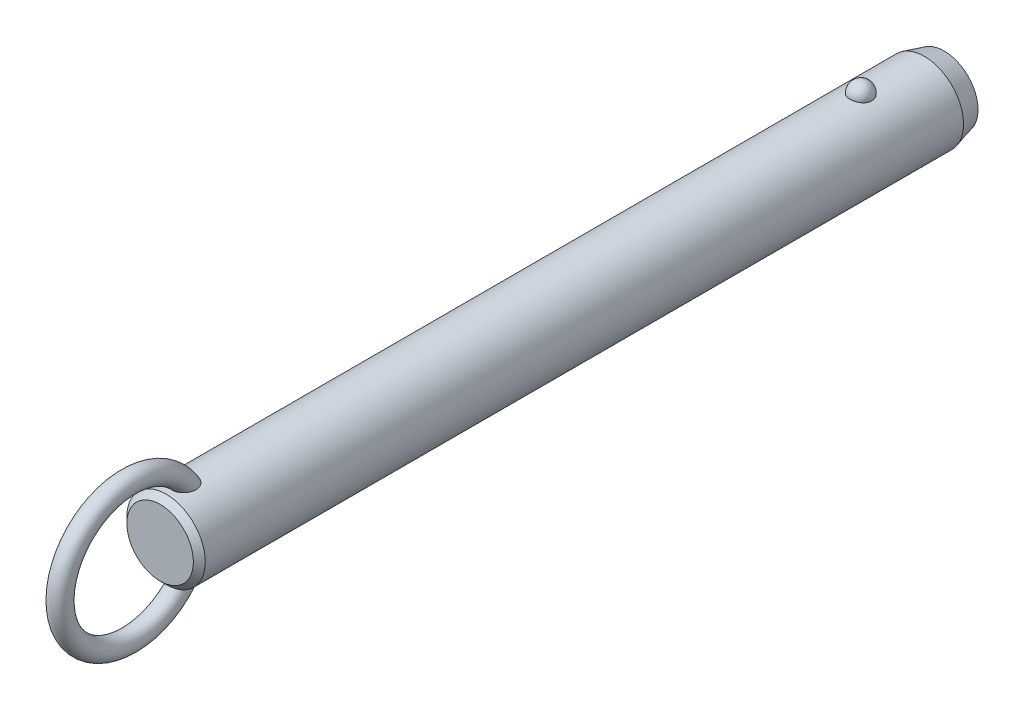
ISO-10303-21;
HEADER;
FILE_DESCRIPTION(('STEP AP214'),'2;1');
FILE_NAME('part.step','',(''),(''),'','','');
FILE_SCHEMA(('AUTOMOTIVE_DESIGN { 1 0 10303 214 1 1 1 1 }'));
ENDSEC;
DATA;
#1=APPLICATION_CONTEXT('core data for automotive mechanical design processes');
#2=APPLICATION_PROTOCOL_DEFINITION('international standard','automotive_design',2000,#1);
#3=PRODUCT_CONTEXT('',#1,'mechanical');
#4=PRODUCT('Part','Part','',(#3));
#5=PRODUCT_RELATED_PRODUCT_CATEGORY('part','',(#4));
#6=PRODUCT_DEFINITION_FORMATION('','',#4);
#7=PRODUCT_DEFINITION_CONTEXT('part definition',#1,'design');
#8=PRODUCT_DEFINITION('design','',#6,#7);
#9=PRODUCT_DEFINITION_SHAPE('','',#8);
#10=(LENGTH_UNIT() NAMED_UNIT(*) SI_UNIT(.MILLI.,.METRE.));
#11=(NAMED_UNIT(*) PLANE_ANGLE_UNIT() SI_UNIT($,.RADIAN.));
#12=(NAMED_UNIT(*) SI_UNIT($,.STERADIAN.) SOLID_ANGLE_UNIT());
#13=UNCERTAINTY_MEASURE_WITH_UNIT(LENGTH_MEASURE(1.E-05),#10,'distance_accuracy_value','');
#14=(GEOMETRIC_REPRESENTATION_CONTEXT(3) GLOBAL_UNCERTAINTY_ASSIGNED_CONTEXT((#13)) GLOBAL_UNIT_ASSIGNED_CONTEXT((#10,
#11,#12)) REPRESENTATION_CONTEXT('',''));
#15=CARTESIAN_POINT('',(0.,0.,0.));
#16=DIRECTION('',(0.,0.,1.));
#17=DIRECTION('',(1.,0.,0.));
#18=AXIS2_PLACEMENT_3D('',#15,#16,#17);
#19=CARTESIAN_POINT('',(0.,0.,129.5));
#20=DIRECTION('',(0.,0.,-1.));
#21=DIRECTION('',(-1.,0.,0.));
#22=AXIS2_PLACEMENT_3D('',#19,#20,#21);
#23=CYLINDRICAL_SURFACE('',#22,7.9);
#24=CARTESIAN_POINT('',(2.1785689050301,7.59367088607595,-2.19999999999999));
#25=CARTESIAN_POINT('',(2.17856679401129,7.59367269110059,-2.07701843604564));
#26=CARTESIAN_POINT('',(2.16853481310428,7.59657145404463,-1.95401006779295));
#27=CARTESIAN_POINT('',(2.12864689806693,7.607843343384,-1.71147811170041));
#28=CARTESIAN_POINT('',(2.09878338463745,7.61621856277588,-1.59195587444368));
#29=CARTESIAN_POINT('',(2.0199931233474,7.63749180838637,-1.3598563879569));
#30=CARTESIAN_POINT('',(1.97107475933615,7.6503878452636,-1.24727610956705));
#31=CARTESIAN_POINT('',(1.85539377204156,7.67926115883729,-1.03213234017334));
#32=CARTESIAN_POINT('',(1.78863158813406,7.69523835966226,-0.929568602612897));
#33=CARTESIAN_POINT('',(1.63856494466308,7.7285848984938,-0.736786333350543));
#34=CARTESIAN_POINT('',(1.55518140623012,7.7459606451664,-0.646630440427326));
#35=CARTESIAN_POINT('',(1.37422937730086,7.78009978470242,-0.481747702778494));
#36=CARTESIAN_POINT('',(1.27666086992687,7.79686317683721,-0.407020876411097));
#37=CARTESIAN_POINT('',(1.07024728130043,7.82786153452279,-0.275278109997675));
#38=CARTESIAN_POINT('',(0.961434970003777,7.84210353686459,-0.218212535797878));
#39=CARTESIAN_POINT('',(0.735351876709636,7.86652194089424,-0.123146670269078));
#40=CARTESIAN_POINT('',(0.618082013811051,7.87669878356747,-0.085144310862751));
#41=CARTESIAN_POINT('',(0.380637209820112,7.89170521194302,-0.0298158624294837));
#42=CARTESIAN_POINT('',(0.260550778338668,7.89662650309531,-0.0121347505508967));
#43=CARTESIAN_POINT('',(0.0190117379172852,7.90090003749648,0.00324379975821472));
#44=CARTESIAN_POINT('',(-0.102440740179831,7.90025280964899,0.00094313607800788));
#45=CARTESIAN_POINT('',(-0.341452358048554,7.89351056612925,-0.0233955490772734));
#46=CARTESIAN_POINT('',(-0.459042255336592,7.88749257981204,-0.0451545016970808));
#47=CARTESIAN_POINT('',(-0.688796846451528,7.87075812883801,-0.107408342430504));
#48=CARTESIAN_POINT('',(-0.800961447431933,7.86004158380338,-0.147903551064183));
#49=CARTESIAN_POINT('',(-1.01743634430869,7.83497131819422,-0.246799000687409));
#50=CARTESIAN_POINT('',(-1.12169791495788,7.82059709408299,-0.305300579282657));
#51=CARTESIAN_POINT('',(-1.31891765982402,7.78976470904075,-0.438549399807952));
#52=CARTESIAN_POINT('',(-1.41187469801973,7.77330633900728,-0.513298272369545));
#53=CARTESIAN_POINT('',(-1.58577142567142,7.73972434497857,-0.678622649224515));
#54=CARTESIAN_POINT('',(-1.66645140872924,7.72259402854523,-0.769470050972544));
#55=CARTESIAN_POINT('',(-1.81161503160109,7.68983776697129,-0.963538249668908));
#56=CARTESIAN_POINT('',(-1.87609753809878,7.6742119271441,-1.06675991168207));
#57=CARTESIAN_POINT('',(-1.98790138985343,7.6460202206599,-1.28401170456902));
#58=CARTESIAN_POINT('',(-2.03501994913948,7.63349104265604,-1.39815107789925));
#59=CARTESIAN_POINT('',(-2.10986724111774,7.6131449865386,-1.63301784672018));
#60=CARTESIAN_POINT('',(-2.1375965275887,7.60532797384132,-1.75374505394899));
#61=CARTESIAN_POINT('',(-2.17289256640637,7.5953195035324,-1.99782562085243));
#62=CARTESIAN_POINT('',(-2.18054294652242,7.59310471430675,-2.12116592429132));
#63=CARTESIAN_POINT('',(-2.17572919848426,7.59448538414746,-2.36741799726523));
#64=CARTESIAN_POINT('',(-2.1632656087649,7.59808068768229,-2.49032977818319));
#65=CARTESIAN_POINT('',(-2.11865035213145,7.61064035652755,-2.73161015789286));
#66=CARTESIAN_POINT('',(-2.08659579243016,7.61957823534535,-2.84999812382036));
#67=CARTESIAN_POINT('',(-2.00367799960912,7.64179982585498,-3.07955956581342));
#68=CARTESIAN_POINT('',(-1.9528140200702,7.65508371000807,-3.19073275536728));
#69=CARTESIAN_POINT('',(-1.83321113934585,7.68460381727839,-3.40337899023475));
#70=CARTESIAN_POINT('',(-1.76437735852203,7.70085556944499,-3.50479651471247));
#71=CARTESIAN_POINT('',(-1.61069526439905,7.73445734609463,-3.69446912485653));
#72=CARTESIAN_POINT('',(-1.52584634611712,7.75180741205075,-3.78272371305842));
#73=CARTESIAN_POINT('',(-1.34198059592,7.78574608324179,-3.94393987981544));
#74=CARTESIAN_POINT('',(-1.24291308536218,7.80233167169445,-4.01684434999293));
#75=CARTESIAN_POINT('',(-1.03352039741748,7.83281625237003,-4.14489386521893));
#76=CARTESIAN_POINT('',(-0.92319600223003,7.84671543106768,-4.20004014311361));
#77=CARTESIAN_POINT('',(-0.695822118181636,7.87011575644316,-4.29042017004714));
#78=CARTESIAN_POINT('',(-0.578872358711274,7.87966903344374,-4.32589112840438));
#79=CARTESIAN_POINT('',(-0.340410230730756,7.8935652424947,-4.37692226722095));
#80=CARTESIAN_POINT('',(-0.218898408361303,7.89790879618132,-4.39248482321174));
#81=CARTESIAN_POINT('',(0.0228107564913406,7.90087453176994,-4.40314405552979));
#82=CARTESIAN_POINT('',(0.142990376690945,7.89960185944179,-4.39861683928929));
#83=CARTESIAN_POINT('',(0.380829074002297,7.89171262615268,-4.37008293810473));
#84=CARTESIAN_POINT('',(0.498488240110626,7.8850962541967,-4.34607694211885));
#85=CARTESIAN_POINT('',(0.727535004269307,7.86726442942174,-4.27939317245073));
#86=CARTESIAN_POINT('',(0.838944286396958,7.85606616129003,-4.236785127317));
#87=CARTESIAN_POINT('',(1.05295421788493,7.83025654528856,-4.13408348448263));
#88=CARTESIAN_POINT('',(1.15555431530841,7.81564498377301,-4.07398879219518));
#89=CARTESIAN_POINT('',(1.35076763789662,7.7843022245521,-3.93687432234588));
#90=CARTESIAN_POINT('',(1.4432046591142,7.76754209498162,-3.85961036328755));
#91=CARTESIAN_POINT('',(1.6139111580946,7.73387857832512,-3.69076949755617));
#92=CARTESIAN_POINT('',(1.6921781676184,7.71697516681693,-3.59919010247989));
#93=CARTESIAN_POINT('',(1.83380875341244,7.6845643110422,-3.40247278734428));
#94=CARTESIAN_POINT('',(1.89689280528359,7.66908588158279,-3.29712873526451));
#95=CARTESIAN_POINT('',(2.0047823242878,7.64159441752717,-3.07707931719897));
#96=CARTESIAN_POINT('',(2.0495945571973,7.62958010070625,-2.96237743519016));
#97=CARTESIAN_POINT('',(2.11580183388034,7.61146617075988,-2.74040519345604));
#98=CARTESIAN_POINT('',(2.13929812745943,7.60484503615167,-2.63379846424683));
#99=CARTESIAN_POINT('',(2.17068242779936,7.59594664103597,-2.41813481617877));
#100=CARTESIAN_POINT('',(2.17857077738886,7.59366928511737,-2.30907795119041));
#101=CARTESIAN_POINT('',(2.1785689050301,7.59367088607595,-2.19999999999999));
#102=B_SPLINE_CURVE_WITH_KNOTS('',3,(#24,#25,#26,#27,#28,#29,#30,#31,#32,#33,#34,#35,#36,#37,
#38,#39,#40,#41,#42,#43,#44,#45,#46,#47,#48,#49,#50,#51,#52,#53,#54,#55,#56,#57,#58,#59,#60,#61,
#62,#63,#64,#65,#66,#67,#68,#69,#70,#71,#72,#73,#74,#75,#76,#77,#78,#79,#80,#81,#82,#83,#84,#85,
#86,#87,#88,#89,#90,#91,#92,#93,#94,#95,#96,#97,#98,#99,#100,#101),.UNSPECIFIED.,.T.,.F.,(4,2,2,
2,2,2,2,2,2,2,2,2,2,2,2,2,2,2,2,2,2,2,2,2,2,2,2,2,2,2,2,2,2,2,2,2,2,2,4),(0.,0.368552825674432,
0.737246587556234,1.10577831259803,1.4743009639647,1.8446206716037,2.21494081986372,
2.5842105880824,2.95344028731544,3.31611630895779,3.67875788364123,4.03628044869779,
4.39380913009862,4.75338791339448,5.11300280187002,5.47939989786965,5.8458226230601,
6.21639834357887,6.58696347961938,6.95598276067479,7.32499216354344,7.69218715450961,
8.0593967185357,8.42858578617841,8.79778880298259,9.16834203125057,9.5388695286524,
9.90482699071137,10.2707407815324,10.6298333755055,10.9889132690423,11.3466585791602,
11.7044262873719,12.0676511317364,12.4309391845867,12.8004764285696,13.1698767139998,
13.4967701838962,13.8236564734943),.UNSPECIFIED.);
#103=CARTESIAN_POINT('',(2.1785689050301,7.59367088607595,-2.19999999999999));
#104=VERTEX_POINT('',#103);
#105=EDGE_CURVE('E41',#104,#104,#102,.T.);
#106=ORIENTED_EDGE('',*,*,#105,.T.);
#107=EDGE_LOOP('',(#106));
#108=FACE_BOUND('',#107,.T.);
#109=CARTESIAN_POINT('',(0.,0.,137.82));
#110=DIRECTION('',(0.,0.,1.));
#111=DIRECTION('',(1.,0.,0.));
#112=AXIS2_PLACEMENT_3D('',#109,#110,#111);
#113=CIRCLE('',#112,7.9);
#114=CARTESIAN_POINT('',(7.9,0.,137.82));
#115=VERTEX_POINT('',#114);
#116=EDGE_CURVE('E10',#115,#115,#113,.F.);
#117=ORIENTED_EDGE('',*,*,#116,.T.);
#118=EDGE_LOOP('',(#117));
#119=FACE_BOUND('',#118,.T.);
#120=CARTESIAN_POINT('',(-0.630969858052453,-7.87476203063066,131.712432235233));
#121=CARTESIAN_POINT('',(-0.734180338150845,-7.86648998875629,131.747285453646));
#122=CARTESIAN_POINT('',(-0.83447695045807,-7.85639291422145,131.790816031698));
#123=CARTESIAN_POINT('',(-1.0262035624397,-7.83366343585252,131.894094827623));
#124=CARTESIAN_POINT('',(-1.1176141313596,-7.82102565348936,131.953877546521));
#125=CARTESIAN_POINT('',(-1.28877277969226,-7.79464922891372,132.087839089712));
#126=CARTESIAN_POINT('',(-1.36854014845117,-7.78091246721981,132.161993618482));
#127=CARTESIAN_POINT('',(-1.51461521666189,-7.75380398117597,132.322494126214));
#128=CARTESIAN_POINT('',(-1.58092966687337,-7.74043207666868,132.408833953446));
#129=CARTESIAN_POINT('',(-1.70019064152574,-7.7151252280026,132.592978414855));
#130=CARTESIAN_POINT('',(-1.75284037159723,-7.70322473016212,132.690979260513));
#131=CARTESIAN_POINT('',(-1.84263464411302,-7.68224112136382,132.894102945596));
#132=CARTESIAN_POINT('',(-1.87977299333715,-7.6731591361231,132.999228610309));
#133=CARTESIAN_POINT('',(-1.94152728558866,-7.65777930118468,133.223284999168));
#134=CARTESIAN_POINT('',(-1.96475471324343,-7.65179654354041,133.342616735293));
#135=CARTESIAN_POINT('',(-1.99449499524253,-7.64409642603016,133.58342986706));
#136=CARTESIAN_POINT('',(-2.0010005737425,-7.64238092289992,133.704912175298));
#137=CARTESIAN_POINT('',(-1.99856014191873,-7.64302120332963,133.968340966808));
#138=CARTESIAN_POINT('',(-1.98680021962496,-7.64611845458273,134.11025654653));
#139=CARTESIAN_POINT('',(-1.94457772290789,-7.65696186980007,134.391118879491));
#140=CARTESIAN_POINT('',(-1.91409393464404,-7.66471330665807,134.530062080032));
#141=CARTESIAN_POINT('',(-1.82768670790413,-7.68582947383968,134.831939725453));
#142=CARTESIAN_POINT('',(-1.76772963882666,-7.70003779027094,134.993686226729));
#143=CARTESIAN_POINT('',(-1.65998501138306,-7.72371550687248,135.227695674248));
#144=CARTESIAN_POINT('',(-1.62107967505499,-7.73200670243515,135.304297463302));
#145=CARTESIAN_POINT('',(-1.53727726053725,-7.7491037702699,135.454079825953));
#146=CARTESIAN_POINT('',(-1.49238215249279,-7.75790947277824,135.527261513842));
#147=CARTESIAN_POINT('',(-1.37397050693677,-7.77993338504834,135.70288382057));
#148=CARTESIAN_POINT('',(-1.29690364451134,-7.79328473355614,135.802955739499));
#149=CARTESIAN_POINT('',(-1.12885487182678,-7.81939266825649,135.990714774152));
#150=CARTESIAN_POINT('',(-1.03789926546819,-7.83215032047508,136.078424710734));
#151=CARTESIAN_POINT('',(-0.869532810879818,-7.85231710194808,136.213414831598));
#152=CARTESIAN_POINT('',(-0.795716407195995,-7.86021093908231,136.265076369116));
#153=CARTESIAN_POINT('',(-0.640813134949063,-7.87434920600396,136.356381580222));
#154=CARTESIAN_POINT('',(-0.559737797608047,-7.88059619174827,136.39604389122));
#155=CARTESIAN_POINT('',(-0.406456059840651,-7.88984116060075,136.454300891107));
#156=CARTESIAN_POINT('',(-0.335227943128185,-7.89321892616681,136.475384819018));
#157=CARTESIAN_POINT('',(-0.190193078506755,-7.89804235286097,136.50541418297));
#158=CARTESIAN_POINT('',(-0.116388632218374,-7.89948969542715,136.514370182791));
#159=CARTESIAN_POINT('',(0.0318414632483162,-7.90028409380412,136.519291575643));
#160=CARTESIAN_POINT('',(0.106268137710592,-7.89962640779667,136.515227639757));
#161=CARTESIAN_POINT('',(0.253290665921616,-7.8962818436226,136.494461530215));
#162=CARTESIAN_POINT('',(0.325885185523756,-7.8935935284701,136.477750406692));
#163=CARTESIAN_POINT('',(0.481441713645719,-7.88577340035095,136.428738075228));
#164=CARTESIAN_POINT('',(0.563611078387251,-7.88026321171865,136.394005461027));
#165=CARTESIAN_POINT('',(0.721129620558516,-7.86741729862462,136.311796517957));
#166=CARTESIAN_POINT('',(0.79646633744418,-7.86007832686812,136.264297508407));
#167=CARTESIAN_POINT('',(0.971456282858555,-7.84073285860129,136.136513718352));
#168=CARTESIAN_POINT('',(1.06719686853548,-7.82809461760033,136.051004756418));
#169=CARTESIAN_POINT('',(1.24418921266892,-7.80192439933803,135.866232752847));
#170=CARTESIAN_POINT('',(1.32540832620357,-7.78839049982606,135.766939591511));
#171=CARTESIAN_POINT('',(1.45199971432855,-7.76559693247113,135.589576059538));
#172=CARTESIAN_POINT('',(1.50085649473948,-7.75626094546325,135.513954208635));
#173=CARTESIAN_POINT('',(1.59197749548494,-7.73807279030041,135.358742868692));
#174=CARTESIAN_POINT('',(1.63423919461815,-7.72922080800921,135.279151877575));
#175=CARTESIAN_POINT('',(1.71222612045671,-7.71231959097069,135.116664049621));
#176=CARTESIAN_POINT('',(1.74794516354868,-7.70427111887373,135.033764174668));
#177=CARTESIAN_POINT('',(1.81270113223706,-7.68929240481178,134.865296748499));
#178=CARTESIAN_POINT('',(1.84173789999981,-7.68236218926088,134.779729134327));
#179=CARTESIAN_POINT('',(1.89322698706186,-7.6698375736,134.60528702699));
#180=CARTESIAN_POINT('',(1.91558744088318,-7.66426199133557,134.516383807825));
#181=CARTESIAN_POINT('',(1.95281367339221,-7.65485915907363,134.336969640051));
#182=CARTESIAN_POINT('',(1.96767946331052,-7.65103190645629,134.246458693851));
#183=CARTESIAN_POINT('',(2.0002145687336,-7.64262981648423,133.973732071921));
#184=CARTESIAN_POINT('',(2.00600691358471,-7.6410871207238,133.789709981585));
#185=CARTESIAN_POINT('',(1.98445334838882,-7.64669564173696,133.476501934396));
#186=CARTESIAN_POINT('',(1.96607186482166,-7.65149688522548,133.346618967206));
#187=CARTESIAN_POINT('',(1.90884967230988,-7.66597624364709,133.091632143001));
#188=CARTESIAN_POINT('',(1.87002101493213,-7.67565148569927,132.966525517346));
#189=CARTESIAN_POINT('',(1.77063986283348,-7.69918471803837,132.72454013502));
#190=CARTESIAN_POINT('',(1.70993724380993,-7.71307150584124,132.607725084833));
#191=CARTESIAN_POINT('',(1.56733070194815,-7.74330306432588,132.388144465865));
#192=CARTESIAN_POINT('',(1.48543692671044,-7.75964665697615,132.285372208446));
#193=CARTESIAN_POINT('',(1.31346177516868,-7.79047523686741,132.109380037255));
#194=CARTESIAN_POINT('',(1.22547278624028,-7.80495298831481,132.034106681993));
#195=CARTESIAN_POINT('',(1.03724352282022,-7.83218597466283,131.900486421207));
#196=CARTESIAN_POINT('',(0.93700840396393,-7.84494192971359,131.842132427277));
#197=CARTESIAN_POINT('',(0.733599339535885,-7.86649045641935,131.747027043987));
#198=CARTESIAN_POINT('',(0.630941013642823,-7.87547134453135,131.709210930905));
#199=CARTESIAN_POINT('',(0.420465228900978,-7.88950708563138,131.651116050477));
#200=CARTESIAN_POINT('',(0.312645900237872,-7.89456050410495,131.63084369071));
#201=CARTESIAN_POINT('',(0.096086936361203,-7.9001518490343,131.608455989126));
#202=CARTESIAN_POINT('',(-0.0126341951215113,-7.90073226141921,131.606169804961));
#203=CARTESIAN_POINT('',(-0.228766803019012,-7.89742350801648,131.619367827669));
#204=CARTESIAN_POINT('',(-0.336180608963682,-7.89354403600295,131.634813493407));
#205=CARTESIAN_POINT('',(-0.473410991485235,-7.88586871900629,131.666217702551));
#206=CARTESIAN_POINT('',(-0.50525779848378,-7.88388984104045,131.674354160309));
#207=CARTESIAN_POINT('',(-0.56848128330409,-7.87958326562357,131.692208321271));
#208=CARTESIAN_POINT('',(-0.59985795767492,-7.87725556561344,131.701926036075));
#209=CARTESIAN_POINT('',(-0.630969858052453,-7.87476203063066,131.712432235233));
#210=B_SPLINE_CURVE_WITH_KNOTS('',3,(#120,#121,#122,#123,#124,#125,#126,#127,#128,#129,#130,
#131,#132,#133,#134,#135,#136,#137,#138,#139,#140,#141,#142,#143,#144,#145,#146,#147,#148,#149,
#150,#151,#152,#153,#154,#155,#156,#157,#158,#159,#160,#161,#162,#163,#164,#165,#166,#167,#168,
#169,#170,#171,#172,#173,#174,#175,#176,#177,#178,#179,#180,#181,#182,#183,#184,#185,#186,#187,
#188,#189,#190,#191,#192,#193,#194,#195,#196,#197,#198,#199,#200,#201,#202,#203,#204,#205,#206,
#207,#208,#209),.UNSPECIFIED.,.T.,.F.,(4,2,2,2,2,2,2,2,2,2,2,2,2,2,2,2,2,2,2,2,2,2,2,2,2,2,2,2,
2,2,2,2,2,2,2,2,2,2,2,2,2,2,2,2,4),(0.,0.327622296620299,0.655945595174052,0.983718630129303,
1.3113267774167,1.64554655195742,1.97989964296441,2.34365728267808,2.70757317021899,
3.13333684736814,3.5595838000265,4.07655306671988,4.33527897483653,4.59391999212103,
4.97382437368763,5.353017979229,5.62348245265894,5.89352465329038,6.11565959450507,
6.33760092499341,6.56004255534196,6.78264174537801,7.04930844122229,7.31645206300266,
7.70130871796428,8.08701995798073,8.35824509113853,8.6295736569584,8.9011573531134,
9.1727474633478,9.44791855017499,9.72308922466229,10.2715298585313,10.6638393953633,
11.0559179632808,11.4507403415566,11.8453740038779,12.1936425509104,12.5417649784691,
12.8695063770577,13.1973674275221,13.5221104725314,13.8461490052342,13.9449071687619,
14.0436660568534),.UNSPECIFIED.);
#211=CARTESIAN_POINT('',(-0.630969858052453,-7.87476203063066,131.712432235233));
#212=VERTEX_POINT('',#211);
#213=EDGE_CURVE('E60',#212,#212,#210,.T.);
#214=ORIENTED_EDGE('',*,*,#213,.T.);
#215=EDGE_LOOP('',(#214));
#216=FACE_BOUND('',#215,.T.);
#217=CARTESIAN_POINT('',(-0.630969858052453,7.87476203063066,131.712432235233));
#218=CARTESIAN_POINT('',(-0.528918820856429,7.88293636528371,131.677979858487));
#219=CARTESIAN_POINT('',(-0.423745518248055,7.88934810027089,131.651915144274));
#220=CARTESIAN_POINT('',(-0.210236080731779,7.8979273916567,131.617282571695));
#221=CARTESIAN_POINT('',(-0.10189380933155,7.90008607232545,131.608751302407));
#222=CARTESIAN_POINT('',(0.114660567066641,7.89990877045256,131.609457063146));
#223=CARTESIAN_POINT('',(0.222872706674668,7.89757640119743,131.61867980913));
#224=CARTESIAN_POINT('',(0.436107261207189,7.88867538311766,131.654652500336));
#225=CARTESIAN_POINT('',(0.541131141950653,7.8821087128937,131.68139425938));
#226=CARTESIAN_POINT('',(0.745085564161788,7.86545130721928,131.751756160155));
#227=CARTESIAN_POINT('',(0.844015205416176,7.85536005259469,131.795378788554));
#228=CARTESIAN_POINT('',(1.03299167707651,7.83275153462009,131.898379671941));
#229=CARTESIAN_POINT('',(1.12303841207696,7.8202342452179,131.957758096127));
#230=CARTESIAN_POINT('',(1.29214734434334,7.79408219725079,132.090864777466));
#231=CARTESIAN_POINT('',(1.37116907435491,7.78044359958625,132.164643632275));
#232=CARTESIAN_POINT('',(1.51597677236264,7.75353170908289,132.324235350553));
#233=CARTESIAN_POINT('',(1.58176261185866,7.74025841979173,132.410048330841));
#234=CARTESIAN_POINT('',(1.70057386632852,7.71504069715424,132.593644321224));
#235=CARTESIAN_POINT('',(1.75320073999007,7.7031425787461,132.691690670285));
#236=CARTESIAN_POINT('',(1.8429376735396,7.68216822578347,132.894893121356));
#237=CARTESIAN_POINT('',(1.88004278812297,7.67309289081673,133.000051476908));
#238=CARTESIAN_POINT('',(1.9417232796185,7.6577294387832,133.224167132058));
#239=CARTESIAN_POINT('',(1.96491037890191,7.65175648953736,133.343524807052));
#240=CARTESIAN_POINT('',(1.9945689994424,7.64407702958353,133.584384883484));
#241=CARTESIAN_POINT('',(2.00103304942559,7.64237242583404,133.70588821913));
#242=CARTESIAN_POINT('',(1.99850166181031,7.64303650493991,133.969368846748));
#243=CARTESIAN_POINT('',(1.98669038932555,7.64614714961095,134.111314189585));
#244=CARTESIAN_POINT('',(1.94436120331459,7.65701701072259,134.392228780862));
#245=CARTESIAN_POINT('',(1.91382203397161,7.66478150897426,134.531194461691));
#246=CARTESIAN_POINT('',(1.82728754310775,7.68592483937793,134.833111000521));
#247=CARTESIAN_POINT('',(1.76725778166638,7.70014685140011,134.994872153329));
#248=CARTESIAN_POINT('',(1.65939700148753,7.72384204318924,135.228891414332));
#249=CARTESIAN_POINT('',(1.62045187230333,7.73213852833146,135.305494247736));
#250=CARTESIAN_POINT('',(1.5365668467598,7.74924489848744,135.455273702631));
#251=CARTESIAN_POINT('',(1.49162892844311,7.75805461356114,135.528451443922));
#252=CARTESIAN_POINT('',(1.37317698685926,7.78007342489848,135.703952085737));
#253=CARTESIAN_POINT('',(1.29612360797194,7.79341423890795,135.803911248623));
#254=CARTESIAN_POINT('',(1.12812043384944,7.81949839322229,135.99145083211));
#255=CARTESIAN_POINT('',(1.03719688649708,7.83224280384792,136.079054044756));
#256=CARTESIAN_POINT('',(0.868871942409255,7.85239026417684,136.21389715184));
#257=CARTESIAN_POINT('',(0.795056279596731,7.86027769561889,136.265511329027));
#258=CARTESIAN_POINT('',(0.640160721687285,7.87440222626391,136.356720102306));
#259=CARTESIAN_POINT('',(0.559092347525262,7.88064188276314,136.396333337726));
#260=CARTESIAN_POINT('',(0.405820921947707,7.8898738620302,136.454505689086));
#261=CARTESIAN_POINT('',(0.334594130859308,7.89324577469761,136.475552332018));
#262=CARTESIAN_POINT('',(0.189568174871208,7.89805733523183,136.505507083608));
#263=CARTESIAN_POINT('',(0.115771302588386,7.89949866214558,136.514425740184));
#264=CARTESIAN_POINT('',(-0.0324359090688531,7.90028156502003,136.51927589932));
#265=CARTESIAN_POINT('',(-0.106847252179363,7.89961843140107,136.515178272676));
#266=CARTESIAN_POINT('',(-0.253834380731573,7.8962642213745,136.494351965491));
#267=CARTESIAN_POINT('',(-0.326408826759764,7.89357170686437,136.477614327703));
#268=CARTESIAN_POINT('',(-0.481962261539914,7.88574179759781,136.428539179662));
#269=CARTESIAN_POINT('',(-0.564145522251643,7.88022507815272,136.393763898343));
#270=CARTESIAN_POINT('',(-0.721685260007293,7.86736646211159,136.311468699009));
#271=CARTESIAN_POINT('',(-0.797029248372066,7.8600213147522,136.263926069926));
#272=CARTESIAN_POINT('',(-0.9720442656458,7.84066026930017,136.136026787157));
#273=CARTESIAN_POINT('',(-1.06779803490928,7.82801274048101,136.050443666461));
#274=CARTESIAN_POINT('',(-1.2448053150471,7.80182621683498,135.865522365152));
#275=CARTESIAN_POINT('',(-1.32602618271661,7.78828530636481,135.766154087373));
#276=CARTESIAN_POINT('',(-1.4525983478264,7.76548487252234,135.588680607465));
#277=CARTESIAN_POINT('',(-1.50143856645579,7.75614818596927,135.513025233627));
#278=CARTESIAN_POINT('',(-1.59252410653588,7.73796020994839,135.357748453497));
#279=CARTESIAN_POINT('',(-1.63476690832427,7.72910910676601,135.278125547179));
#280=CARTESIAN_POINT('',(-1.71271318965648,7.71221133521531,135.115575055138));
#281=CARTESIAN_POINT('',(-1.74841047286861,7.70416543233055,135.032644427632));
#282=CARTESIAN_POINT('',(-1.81311929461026,7.6891937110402,134.864116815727));
#283=CARTESIAN_POINT('',(-1.84213067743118,7.68226791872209,134.778519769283));
#284=CARTESIAN_POINT('',(-1.89356259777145,7.66975461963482,134.604025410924));
#285=CARTESIAN_POINT('',(-1.91589165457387,7.66418586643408,134.515099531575));
#286=CARTESIAN_POINT('',(-1.9530507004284,7.65479859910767,134.335642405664));
#287=CARTESIAN_POINT('',(-1.96788069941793,7.65098008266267,134.245111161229));
#288=CARTESIAN_POINT('',(-2.00030078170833,7.64260704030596,133.972327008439));
#289=CARTESIAN_POINT('',(-2.00600576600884,7.64108760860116,133.788271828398));
#290=CARTESIAN_POINT('',(-1.9842848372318,7.64673945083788,133.475080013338));
#291=CARTESIAN_POINT('',(-1.96583698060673,7.65155751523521,133.345240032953));
#292=CARTESIAN_POINT('',(-1.90848948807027,7.66606613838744,133.090361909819));
#293=CARTESIAN_POINT('',(-1.86960376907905,7.67575338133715,132.965320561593));
#294=CARTESIAN_POINT('',(-1.77013421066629,7.6993013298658,132.723500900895));
#295=CARTESIAN_POINT('',(-1.70940488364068,7.71318991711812,132.606784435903));
#296=CARTESIAN_POINT('',(-1.56672953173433,7.74342495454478,132.387340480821));
#297=CARTESIAN_POINT('',(-1.48478316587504,7.75977144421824,132.28461321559));
#298=CARTESIAN_POINT('',(-1.31266325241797,7.79061163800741,132.108643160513));
#299=CARTESIAN_POINT('',(-1.22456383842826,7.80509908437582,132.033358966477));
#300=CARTESIAN_POINT('',(-1.03622400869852,7.83231881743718,131.899865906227));
#301=CARTESIAN_POINT('',(-0.936015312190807,7.84505551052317,131.841613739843));
#302=CARTESIAN_POINT('',(-0.798824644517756,7.85957802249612,131.777540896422));
#303=CARTESIAN_POINT('',(-0.765787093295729,7.86286821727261,131.763224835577));
#304=CARTESIAN_POINT('',(-0.698939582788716,7.86909211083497,131.736436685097));
#305=CARTESIAN_POINT('',(-0.66512963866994,7.8720258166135,131.723964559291));
#306=CARTESIAN_POINT('',(-0.630969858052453,7.87476203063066,131.712432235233));
#307=B_SPLINE_CURVE_WITH_KNOTS('',3,(#217,#218,#219,#220,#221,#222,#223,#224,#225,#226,#227,
#228,#229,#230,#231,#232,#233,#234,#235,#236,#237,#238,#239,#240,#241,#242,#243,#244,#245,#246,
#247,#248,#249,#250,#251,#252,#253,#254,#255,#256,#257,#258,#259,#260,#261,#262,#263,#264,#265,
#266,#267,#268,#269,#270,#271,#272,#273,#274,#275,#276,#277,#278,#279,#280,#281,#282,#283,#284,
#285,#286,#287,#288,#289,#290,#291,#292,#293,#294,#295,#296,#297,#298,#299,#300,#301,#302,#303,
#304,#305,#306),.UNSPECIFIED.,.T.,.F.,(4,2,2,2,2,2,2,2,2,2,2,2,2,2,2,2,2,2,2,2,2,2,2,2,2,2,2,2,
2,2,2,2,2,2,2,2,2,2,2,2,2,2,2,2,4),(0.,0.323920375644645,0.648516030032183,0.972850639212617,
1.29703380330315,1.62126473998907,1.94549915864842,2.27089401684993,2.5962920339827,
2.93059633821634,3.26500707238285,3.6288164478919,3.99278833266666,4.4186542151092,
4.84500434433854,5.36209210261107,5.62087589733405,5.87957448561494,6.25918598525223,
6.63808782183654,6.90846748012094,7.17842501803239,7.40052350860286,7.6224287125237,
7.84483086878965,8.06739077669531,8.33414615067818,8.60137921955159,8.98641454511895,
9.37230415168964,9.64358673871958,9.91497268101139,10.1866142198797,10.4582620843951,
10.7334745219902,11.008686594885,11.5572126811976,11.9494246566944,12.3413699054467,
12.7359755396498,13.1305875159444,13.4791770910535,13.82687259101,13.9353013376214,
14.0437279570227),.UNSPECIFIED.);
#308=CARTESIAN_POINT('',(-0.630969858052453,7.87476203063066,131.712432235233));
#309=VERTEX_POINT('',#308);
#310=EDGE_CURVE('E67',#309,#309,#307,.T.);
#311=ORIENTED_EDGE('',*,*,#310,.T.);
#312=EDGE_LOOP('',(#311));
#313=FACE_BOUND('',#312,.T.);
#314=CARTESIAN_POINT('',(0.,0.,-15.));
#315=DIRECTION('',(0.,0.,-1.));
#316=DIRECTION('',(-1.,0.,0.));
#317=AXIS2_PLACEMENT_3D('',#314,#315,#316);
#318=CIRCLE('',#317,7.9);
#319=CARTESIAN_POINT('',(-7.9,0.,-15.));
#320=VERTEX_POINT('',#319);
#321=EDGE_CURVE('E57',#320,#320,#318,.F.);
#322=ORIENTED_EDGE('',*,*,#321,.T.);
#323=EDGE_LOOP('',(#322));
#324=FACE_BOUND('',#323,.T.);
#325=ADVANCED_FACE('F37',(#108,#119,#216,#313,#324),#23,.T.);
#326=CARTESIAN_POINT('',(0.,0.,-19.));
#327=DIRECTION('',(0.,0.,-1.));
#328=DIRECTION('',(-1.,0.,0.));
#329=AXIS2_PLACEMENT_3D('',#326,#327,#328);
#330=PLANE('',#329);
#331=CARTESIAN_POINT('',(0.,0.,-19.));
#332=DIRECTION('',(0.,0.,-1.));
#333=DIRECTION('',(-1.,0.,0.));
#334=AXIS2_PLACEMENT_3D('',#331,#332,#333);
#335=CIRCLE('',#334,6.82820323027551);
#336=CARTESIAN_POINT('',(-6.82820323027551,0.,-19.));
#337=VERTEX_POINT('',#336);
#338=EDGE_CURVE('E66',#337,#337,#335,.T.);
#339=ORIENTED_EDGE('',*,*,#338,.T.);
#340=EDGE_LOOP('',(#339));
#341=FACE_BOUND('',#340,.T.);
#342=ADVANCED_FACE('F85',(#341),#330,.T.);
#343=CARTESIAN_POINT('',(0.,0.,-19.));
#344=DIRECTION('',(0.,0.,1.));
#345=DIRECTION('',(1.,0.,0.));
#346=AXIS2_PLACEMENT_3D('',#343,#344,#345);
#347=CONICAL_SURFACE('',#346,6.82820323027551,0.261799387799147);
#348=ORIENTED_EDGE('',*,*,#321,.F.);
#349=EDGE_LOOP('',(#348));
#350=FACE_BOUND('',#349,.T.);
#351=ORIENTED_EDGE('',*,*,#338,.F.);
#352=EDGE_LOOP('',(#351));
#353=FACE_BOUND('',#352,.T.);
#354=ADVANCED_FACE('F83',(#350,#353),#347,.T.);
#355=CARTESIAN_POINT('',(0.,0.,139.02));
#356=DIRECTION('',(0.,0.,1.));
#357=DIRECTION('',(1.,0.,0.));
#358=AXIS2_PLACEMENT_3D('',#355,#356,#357);
#359=PLANE('',#358);
#360=CARTESIAN_POINT('',(0.,0.,139.02));
#361=DIRECTION('',(0.,0.,1.));
#362=DIRECTION('',(1.,0.,0.));
#363=AXIS2_PLACEMENT_3D('',#360,#361,#362);
#364=CIRCLE('',#363,6.69999999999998);
#365=CARTESIAN_POINT('',(6.69999999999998,0.,139.02));
#366=VERTEX_POINT('',#365);
#367=EDGE_CURVE('E50',#366,#366,#364,.T.);
#368=ORIENTED_EDGE('',*,*,#367,.T.);
#369=EDGE_LOOP('',(#368));
#370=FACE_BOUND('',#369,.T.);
#371=ADVANCED_FACE('F77',(#370),#359,.T.);
#372=CARTESIAN_POINT('',(0.,0.,145.35));
#373=DIRECTION('',(1.,0.,0.));
#374=DIRECTION('',(0.,0.,-1.));
#375=AXIS2_PLACEMENT_3D('',#372,#373,#374);
#376=TOROIDAL_SURFACE('',#375,13.85,2.);
#377=ORIENTED_EDGE('',*,*,#310,.F.);
#378=EDGE_LOOP('',(#377));
#379=FACE_BOUND('',#378,.T.);
#380=ORIENTED_EDGE('',*,*,#213,.F.);
#381=EDGE_LOOP('',(#380));
#382=FACE_BOUND('',#381,.T.);
#383=ADVANCED_FACE('F73',(#379,#382),#376,.T.);
#384=CARTESIAN_POINT('',(0.,0.,139.02));
#385=DIRECTION('',(0.,0.,-1.));
#386=DIRECTION('',(-1.,0.,0.));
#387=AXIS2_PLACEMENT_3D('',#384,#385,#386);
#388=CONICAL_SURFACE('',#387,6.69999999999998,0.785398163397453);
#389=ORIENTED_EDGE('',*,*,#116,.F.);
#390=EDGE_LOOP('',(#389));
#391=FACE_BOUND('',#390,.T.);
#392=ORIENTED_EDGE('',*,*,#367,.F.);
#393=EDGE_LOOP('',(#392));
#394=FACE_BOUND('',#393,.T.);
#395=ADVANCED_FACE('F39',(#391,#394),#388,.T.);
#396=CARTESIAN_POINT('',(0.,7.9,-2.19999999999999));
#397=DIRECTION('',(0.,1.,0.));
#398=DIRECTION('',(0.,0.,-1.));
#399=AXIS2_PLACEMENT_3D('',#396,#397,#398);
#400=SPHERICAL_SURFACE('',#399,2.2);
#401=ORIENTED_EDGE('',*,*,#105,.F.);
#402=EDGE_LOOP('',(#401));
#403=FACE_BOUND('',#402,.T.);
#404=ADVANCED_FACE('F79',(#403),#400,.T.);
#405=CLOSED_SHELL('',(#325,#342,#354,#371,#383,#395,#404));
#406=MANIFOLD_SOLID_BREP('B2',#405);
#407=ADVANCED_BREP_SHAPE_REPRESENTATION('',(#18,#406),#14);
#408=SHAPE_DEFINITION_REPRESENTATION(#9,#407);
ENDSEC;
END-ISO-10303-21;
